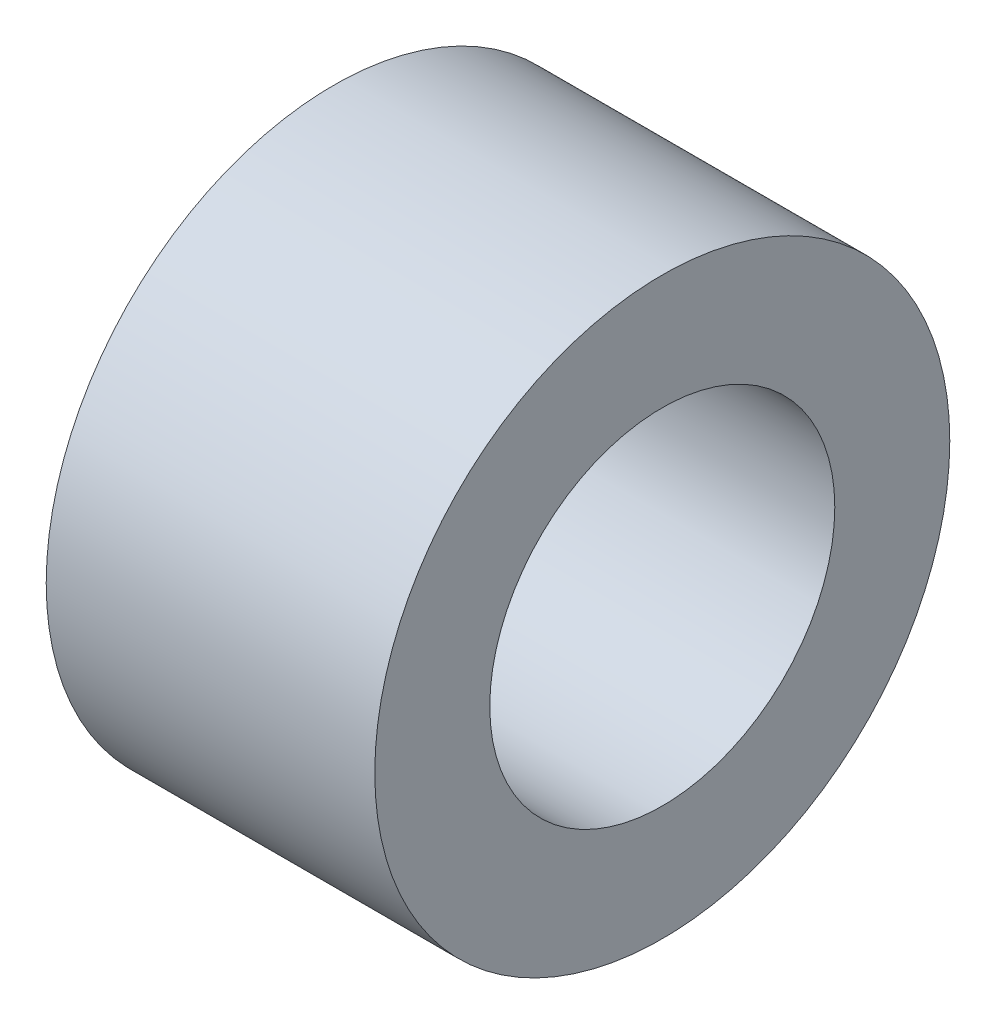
from build123d import *

# Parameters (mm, degrees)
ESQUISSE1_W = 8
ESQUISSE1_H = 2.8


with BuildPart() as part:
    # Esquisse1 → Base-R_volution (revolve)
    with BuildSketch(Plane(origin=(0, 0, 0), x_dir=(1, 0, 0), z_dir=(0, 1, 0)), mode=Mode.PRIVATE) as base_r_volution_sk:
        with Locations((4, 5.6)):
            Rectangle(ESQUISSE1_W, ESQUISSE1_H)
    revolve(base_r_volution_sk.sketch.rotate(Axis((0, 0, 0), (1, 0, 0)), 180), axis=Axis((0, 0, 0), (1, 0, 0)))


solid = part.part
